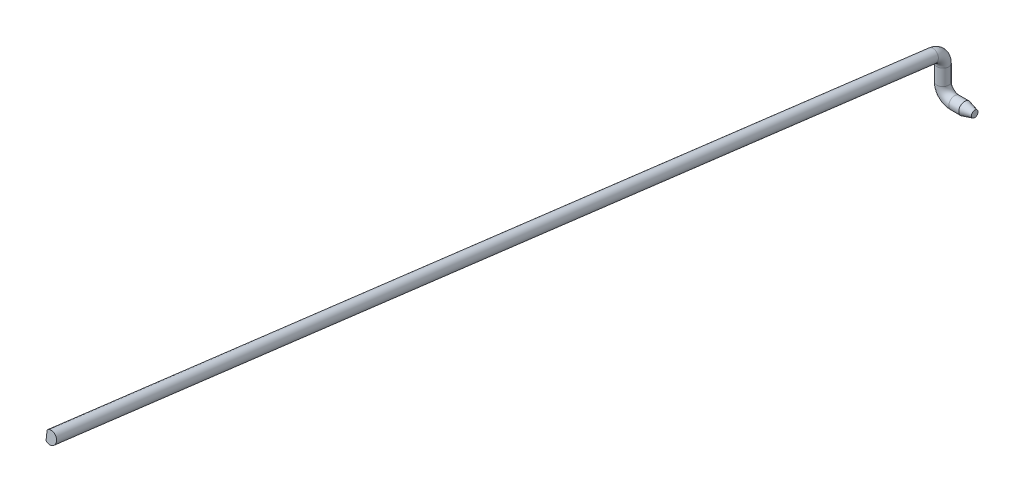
from build123d import *

# Parameters (mm, degrees)
SKETCH2_R          = 1.5
SKETCH4_R          = 1.5
CHAMFER1_SIZE      = 2.5
CHAMFER1_SIZE2     = 0.669872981
CUT_EXTRUDE1_DEPTH = 227.906138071


with BuildPart() as part:
    # Sweep1: sweep along a path in Sketch1
    with BuildLine(Plane(origin=(0, 0, 0), x_dir=(0, 0, -1), z_dir=(1, 0, 0))) as sweep1_path:
        Line((0, 0), (0, 2))
        ThreePointArc((0, 2), (-0.751070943, 3.985527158), (-2.628212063, 4.976873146))
        Line((-2.628212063, 4.976873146), (-219, 32))
        Line((-219, 32), (-223.961455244, 32.619646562))
    # Sketch2 → Sweep1 (sweep)
    with BuildSketch(Plane(origin=(0, 0, 0), x_dir=(1, 0, 0), z_dir=(0, 1, 0))):
        Circle(SKETCH2_R)
    sweep(path=sweep1_path.line)

    # Sweep2: sweep along a path in Sketch3
    with BuildLine(Plane.XY) as sweep2_path:
        Line((0, 0), (0, -2))
        ThreePointArc((0, -2), (0.878679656, -4.121320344), (3, -5))
        Line((3, -5), (8, -5))
    # Sketch4 → Sweep2 (sweep)
    with BuildSketch(Plane.XZ):
        Circle(SKETCH4_R)
    sweep(path=sweep2_path.line)

    # Chamfer1
    chamfer1_edges = [part.edges().sort_by_distance(p)[0] for p in [
        (8, -6.5, 0),
    ]]
    chamfer1_side = [part.faces().sort_by_distance(p)[0] for p in [
        (5.5, -6.5, 0),
    ]]
    chamfer(chamfer1_edges, length=CHAMFER1_SIZE, length2=CHAMFER1_SIZE2, reference=chamfer1_side[0])

    # Sketch5 → Cut-Extrude1 (cut, through all)
    with BuildSketch(Plane(origin=(-1, 0, 0), x_dir=(0, 0, -1), z_dir=(1, 0, 0))):
        Polygon((-224.209313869, 30.635064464), (-223.713596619, 34.604228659), (-208.829230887, 32.745288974), (-209.324948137, 28.776124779), align=None)
    extrude(amount=-CUT_EXTRUDE1_DEPTH, mode=Mode.SUBTRACT)


solid = part.part
